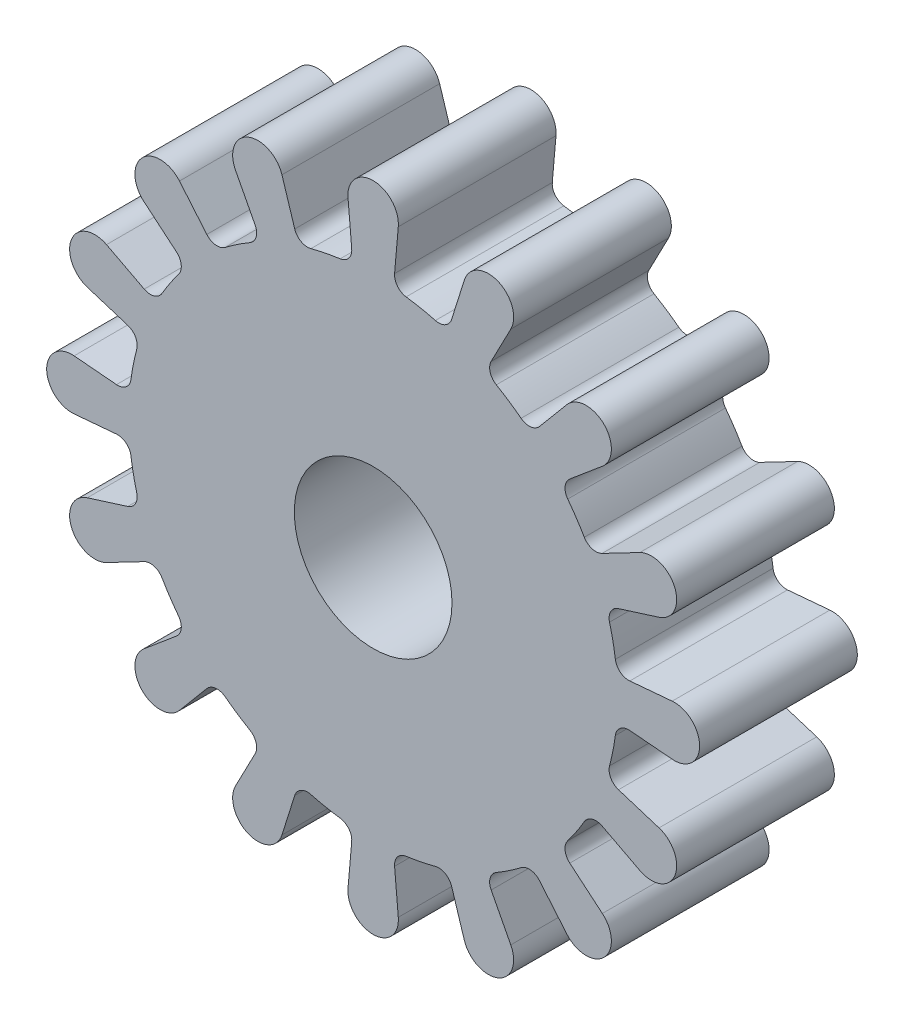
from build123d import *

# Parameters (mm, degrees)
SKETCH_1_R      = 5
EXTRUDE_1_DEPTH = 10


with BuildPart() as part:
    # Sketch 1 → Extrude 1 (new body)
    with BuildSketch(Plane.XY):
        with BuildLine():
            Line((-1.593911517, 18.960550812), (-1.358923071, 16.274620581))
            ThreePointArc((-1.358923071, 16.274620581), (-1.541613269, 15.669968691), (-2.09101974, 15.358308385))
            ThreePointArc((-2.09101974, 15.358308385), (-3.023899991, 15.202171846), (-3.945519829, 14.989425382))
            ThreePointArc((-3.945519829, 14.989425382), (-4.572372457, 15.067113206), (-4.972546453, 15.555826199))
            Line((-4.972546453, 15.555826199), (-5.783306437, 18.12722835))
            ThreePointArc((-5.783306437, 18.12722835), (-7.92154705, 19.124306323), (-8.728470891, 16.90730129))
            Line((-8.728470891, 16.90730129), (-7.483508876, 14.515751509))
            ThreePointArc((-7.483508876, 14.515751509), (-7.420902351, 13.887213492), (-7.809220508, 13.38902816))
            ThreePointArc((-7.809220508, 13.38902816), (-8.611338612, 12.887778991), (-9.381389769, 12.338538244))
            ThreePointArc((-9.381389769, 12.338538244), (-9.990255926, 12.17042632), (-10.546990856, 12.468798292))
            Line((-10.546990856, 12.468798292), (-12.280068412, 14.534199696))
            ThreePointArc((-12.280068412, 14.534199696), (-14.637110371, 14.637110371), (-14.534199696, 12.280068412))
            Line((-14.534199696, 12.280068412), (-12.468798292, 10.546990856))
            ThreePointArc((-12.468798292, 10.546990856), (-12.17042632, 9.990255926), (-12.338538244, 9.381389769))
            ThreePointArc((-12.338538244, 9.381389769), (-12.887778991, 8.611338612), (-13.38902816, 7.809220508))
            ThreePointArc((-13.38902816, 7.809220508), (-13.887213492, 7.420902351), (-14.515751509, 7.483508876))
            Line((-14.515751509, 7.483508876), (-16.90730129, 8.728470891))
            ThreePointArc((-16.90730129, 8.728470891), (-19.124306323, 7.92154705), (-18.12722835, 5.783306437))
            Line((-18.12722835, 5.783306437), (-15.555826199, 4.972546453))
            ThreePointArc((-15.555826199, 4.972546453), (-15.067113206, 4.572372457), (-14.989425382, 3.945519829))
            ThreePointArc((-14.989425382, 3.945519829), (-15.202171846, 3.023899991), (-15.358308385, 2.09101974))
            ThreePointArc((-15.358308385, 2.09101974), (-15.669968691, 1.541613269), (-16.274620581, 1.358923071))
            Line((-16.274620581, 1.358923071), (-18.960550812, 1.593911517))
            ThreePointArc((-18.960550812, 1.593911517), (-20.7, 0), (-18.960550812, -1.593911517))
            Line((-18.960550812, -1.593911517), (-16.274620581, -1.358923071))
            ThreePointArc((-16.274620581, -1.358923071), (-15.669968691, -1.541613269), (-15.358308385, -2.09101974))
            ThreePointArc((-15.358308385, -2.09101974), (-15.202171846, -3.023899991), (-14.989425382, -3.945519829))
            ThreePointArc((-14.989425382, -3.945519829), (-15.067113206, -4.572372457), (-15.555826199, -4.972546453))
            Line((-15.555826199, -4.972546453), (-18.12722835, -5.783306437))
            ThreePointArc((-18.12722835, -5.783306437), (-19.124306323, -7.92154705), (-16.90730129, -8.728470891))
            Line((-16.90730129, -8.728470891), (-14.515751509, -7.483508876))
            ThreePointArc((-14.515751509, -7.483508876), (-13.887213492, -7.420902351), (-13.38902816, -7.809220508))
            ThreePointArc((-13.38902816, -7.809220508), (-12.887778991, -8.611338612), (-12.338538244, -9.381389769))
            ThreePointArc((-12.338538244, -9.381389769), (-12.17042632, -9.990255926), (-12.468798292, -10.546990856))
            Line((-12.468798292, -10.546990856), (-14.534199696, -12.280068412))
            ThreePointArc((-14.534199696, -12.280068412), (-14.637110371, -14.637110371), (-12.280068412, -14.534199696))
            Line((-12.280068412, -14.534199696), (-10.546990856, -12.468798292))
            ThreePointArc((-10.546990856, -12.468798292), (-9.990255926, -12.17042632), (-9.381389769, -12.338538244))
            ThreePointArc((-9.381389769, -12.338538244), (-8.611338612, -12.887778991), (-7.809220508, -13.38902816))
            ThreePointArc((-7.809220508, -13.38902816), (-7.420902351, -13.887213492), (-7.483508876, -14.515751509))
            Line((-7.483508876, -14.515751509), (-8.728470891, -16.90730129))
            ThreePointArc((-8.728470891, -16.90730129), (-7.92154705, -19.124306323), (-5.783306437, -18.12722835))
            Line((-5.783306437, -18.12722835), (-4.972546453, -15.555826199))
            ThreePointArc((-4.972546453, -15.555826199), (-4.572372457, -15.067113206), (-3.945519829, -14.989425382))
            ThreePointArc((-3.945519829, -14.989425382), (-3.023899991, -15.202171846), (-2.09101974, -15.358308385))
            ThreePointArc((-2.09101974, -15.358308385), (-1.541613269, -15.669968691), (-1.358923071, -16.274620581))
            Line((-1.358923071, -16.274620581), (-1.593911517, -18.960550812))
            ThreePointArc((-1.593911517, -18.960550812), (0, -20.7), (1.593911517, -18.960550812))
            Line((1.593911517, -18.960550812), (1.358923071, -16.274620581))
            ThreePointArc((1.358923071, -16.274620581), (1.541613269, -15.669968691), (2.09101974, -15.358308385))
            ThreePointArc((2.09101974, -15.358308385), (3.023899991, -15.202171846), (3.945519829, -14.989425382))
            ThreePointArc((3.945519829, -14.989425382), (4.572372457, -15.067113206), (4.972546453, -15.555826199))
            Line((4.972546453, -15.555826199), (5.783306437, -18.12722835))
            ThreePointArc((5.783306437, -18.12722835), (7.92154705, -19.124306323), (8.728470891, -16.90730129))
            Line((8.728470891, -16.90730129), (7.483508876, -14.515751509))
            ThreePointArc((7.483508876, -14.515751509), (7.420902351, -13.887213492), (7.809220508, -13.38902816))
            ThreePointArc((7.809220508, -13.38902816), (8.611338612, -12.887778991), (9.381389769, -12.338538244))
            ThreePointArc((9.381389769, -12.338538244), (9.990255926, -12.17042632), (10.546990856, -12.468798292))
            Line((10.546990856, -12.468798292), (12.280068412, -14.534199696))
            ThreePointArc((12.280068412, -14.534199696), (14.637110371, -14.637110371), (14.534199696, -12.280068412))
            Line((14.534199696, -12.280068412), (12.468798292, -10.546990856))
            ThreePointArc((12.468798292, -10.546990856), (12.17042632, -9.990255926), (12.338538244, -9.381389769))
            ThreePointArc((12.338538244, -9.381389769), (12.887778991, -8.611338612), (13.38902816, -7.809220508))
            ThreePointArc((13.38902816, -7.809220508), (13.887213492, -7.420902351), (14.515751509, -7.483508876))
            Line((14.515751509, -7.483508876), (16.90730129, -8.728470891))
            ThreePointArc((16.90730129, -8.728470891), (19.124306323, -7.92154705), (18.12722835, -5.783306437))
            Line((18.12722835, -5.783306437), (15.555826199, -4.972546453))
            ThreePointArc((15.555826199, -4.972546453), (15.067113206, -4.572372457), (14.989425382, -3.945519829))
            ThreePointArc((14.989425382, -3.945519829), (15.202171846, -3.023899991), (15.358308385, -2.09101974))
            ThreePointArc((15.358308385, -2.09101974), (15.669968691, -1.541613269), (16.274620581, -1.358923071))
            Line((16.274620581, -1.358923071), (18.960550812, -1.593911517))
            ThreePointArc((18.960550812, -1.593911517), (20.7, 0), (18.960550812, 1.593911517))
            Line((18.960550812, 1.593911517), (16.274620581, 1.358923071))
            ThreePointArc((16.274620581, 1.358923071), (15.669968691, 1.541613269), (15.358308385, 2.09101974))
            ThreePointArc((15.358308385, 2.09101974), (15.202171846, 3.023899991), (14.989425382, 3.945519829))
            ThreePointArc((14.989425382, 3.945519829), (15.067113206, 4.572372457), (15.555826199, 4.972546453))
            Line((15.555826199, 4.972546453), (18.12722835, 5.783306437))
            ThreePointArc((18.12722835, 5.783306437), (19.124306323, 7.92154705), (16.90730129, 8.728470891))
            Line((16.90730129, 8.728470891), (14.515751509, 7.483508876))
            ThreePointArc((14.515751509, 7.483508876), (13.887213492, 7.420902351), (13.38902816, 7.809220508))
            ThreePointArc((13.38902816, 7.809220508), (12.887778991, 8.611338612), (12.338538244, 9.381389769))
            ThreePointArc((12.338538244, 9.381389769), (12.17042632, 9.990255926), (12.468798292, 10.546990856))
            Line((12.468798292, 10.546990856), (14.534199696, 12.280068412))
            ThreePointArc((14.534199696, 12.280068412), (14.637110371, 14.637110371), (12.280068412, 14.534199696))
            Line((12.280068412, 14.534199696), (10.546990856, 12.468798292))
            ThreePointArc((10.546990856, 12.468798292), (9.990255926, 12.17042632), (9.381389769, 12.338538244))
            ThreePointArc((9.381389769, 12.338538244), (8.611338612, 12.887778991), (7.809220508, 13.38902816))
            ThreePointArc((7.809220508, 13.38902816), (7.420902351, 13.887213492), (7.483508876, 14.515751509))
            Line((7.483508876, 14.515751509), (8.728470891, 16.90730129))
            ThreePointArc((8.728470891, 16.90730129), (7.92154705, 19.124306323), (5.783306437, 18.12722835))
            Line((5.783306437, 18.12722835), (4.972546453, 15.555826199))
            ThreePointArc((4.972546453, 15.555826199), (4.572372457, 15.067113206), (3.945519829, 14.989425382))
            ThreePointArc((3.945519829, 14.989425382), (3.023899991, 15.202171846), (2.09101974, 15.358308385))
            ThreePointArc((2.09101974, 15.358308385), (1.541613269, 15.669968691), (1.358923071, 16.274620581))
            Line((1.358923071, 16.274620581), (1.593911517, 18.960550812))
            ThreePointArc((1.593911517, 18.960550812), (0, 20.7), (-1.593911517, 18.960550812))
        make_face()
        Circle(SKETCH_1_R, mode=Mode.SUBTRACT)
    extrude(amount=EXTRUDE_1_DEPTH)


solid = part.part
